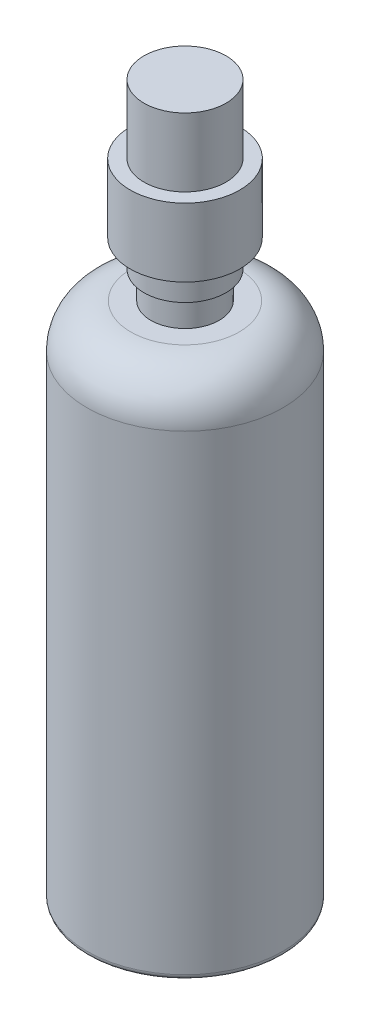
ISO-10303-21;
HEADER;
FILE_DESCRIPTION(('STEP AP214'),'2;1');
FILE_NAME('part.step','',(''),(''),'','','');
FILE_SCHEMA(('AUTOMOTIVE_DESIGN { 1 0 10303 214 1 1 1 1 }'));
ENDSEC;
DATA;
#1=APPLICATION_CONTEXT('core data for automotive mechanical design processes');
#2=APPLICATION_PROTOCOL_DEFINITION('international standard','automotive_design',2000,#1);
#3=PRODUCT_CONTEXT('',#1,'mechanical');
#4=PRODUCT('Part','Part','',(#3));
#5=PRODUCT_RELATED_PRODUCT_CATEGORY('part','',(#4));
#6=PRODUCT_DEFINITION_FORMATION('','',#4);
#7=PRODUCT_DEFINITION_CONTEXT('part definition',#1,'design');
#8=PRODUCT_DEFINITION('design','',#6,#7);
#9=PRODUCT_DEFINITION_SHAPE('','',#8);
#10=(LENGTH_UNIT() NAMED_UNIT(*) SI_UNIT(.MILLI.,.METRE.));
#11=(NAMED_UNIT(*) PLANE_ANGLE_UNIT() SI_UNIT($,.RADIAN.));
#12=(NAMED_UNIT(*) SI_UNIT($,.STERADIAN.) SOLID_ANGLE_UNIT());
#13=UNCERTAINTY_MEASURE_WITH_UNIT(LENGTH_MEASURE(1.E-05),#10,'distance_accuracy_value','');
#14=(GEOMETRIC_REPRESENTATION_CONTEXT(3) GLOBAL_UNCERTAINTY_ASSIGNED_CONTEXT((#13)) GLOBAL_UNIT_ASSIGNED_CONTEXT((#10,
#11,#12)) REPRESENTATION_CONTEXT('',''));
#15=CARTESIAN_POINT('',(0.,0.,0.));
#16=DIRECTION('',(0.,0.,1.));
#17=DIRECTION('',(1.,0.,0.));
#18=AXIS2_PLACEMENT_3D('',#15,#16,#17);
#19=CARTESIAN_POINT('',(0.,0.,0.));
#20=DIRECTION('',(0.,1.,0.));
#21=DIRECTION('',(0.,0.,1.));
#22=AXIS2_PLACEMENT_3D('',#19,#20,#21);
#23=PLANE('',#22);
#24=CARTESIAN_POINT('',(0.,0.,0.));
#25=DIRECTION('',(0.,1.,0.));
#26=DIRECTION('',(0.,0.,1.));
#27=AXIS2_PLACEMENT_3D('',#24,#25,#26);
#28=CIRCLE('',#27,42.96);
#29=CARTESIAN_POINT('',(0.,0.,42.96));
#30=VERTEX_POINT('',#29);
#31=EDGE_CURVE('E53',#30,#30,#28,.F.);
#32=ORIENTED_EDGE('',*,*,#31,.T.);
#33=EDGE_LOOP('',(#32));
#34=FACE_BOUND('',#33,.T.);
#35=ADVANCED_FACE('F45',(#34),#23,.F.);
#36=CARTESIAN_POINT('',(0.,-4.56341729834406,0.));
#37=DIRECTION('',(0.,-1.,0.));
#38=DIRECTION('',(0.,0.,-1.));
#39=AXIS2_PLACEMENT_3D('',#36,#37,#38);
#40=CYLINDRICAL_SURFACE('',#39,45.5);
#41=CARTESIAN_POINT('',(0.,2.54,0.));
#42=DIRECTION('',(0.,1.,0.));
#43=DIRECTION('',(0.,0.,1.));
#44=AXIS2_PLACEMENT_3D('',#41,#42,#43);
#45=CIRCLE('',#44,45.5);
#46=CARTESIAN_POINT('',(0.,2.54,45.5));
#47=VERTEX_POINT('',#46);
#48=EDGE_CURVE('E10',#47,#47,#45,.T.);
#49=ORIENTED_EDGE('',*,*,#48,.T.);
#50=EDGE_LOOP('',(#49));
#51=FACE_BOUND('',#50,.T.);
#52=CARTESIAN_POINT('',(0.,220.98,0.));
#53=DIRECTION('',(0.,-1.,0.));
#54=DIRECTION('',(0.,0.,-1.));
#55=AXIS2_PLACEMENT_3D('',#52,#53,#54);
#56=CIRCLE('',#55,45.5);
#57=CARTESIAN_POINT('',(0.,220.98,-45.5));
#58=VERTEX_POINT('',#57);
#59=EDGE_CURVE('E63',#58,#58,#56,.T.);
#60=ORIENTED_EDGE('',*,*,#59,.T.);
#61=EDGE_LOOP('',(#60));
#62=FACE_BOUND('',#61,.T.);
#63=ADVANCED_FACE('F118',(#51,#62),#40,.T.);
#64=CARTESIAN_POINT('',(-45.5,241.3,0.));
#65=DIRECTION('',(0.,-1.,0.));
#66=DIRECTION('',(0.,0.,-1.));
#67=AXIS2_PLACEMENT_3D('',#64,#65,#66);
#68=PLANE('',#67);
#69=CARTESIAN_POINT('',(0.,241.3,0.));
#70=DIRECTION('',(0.,-1.,0.));
#71=DIRECTION('',(0.,0.,-1.));
#72=AXIS2_PLACEMENT_3D('',#69,#70,#71);
#73=CIRCLE('',#72,25.18);
#74=CARTESIAN_POINT('',(0.,241.3,-25.18));
#75=VERTEX_POINT('',#74);
#76=EDGE_CURVE('E58',#75,#75,#73,.F.);
#77=ORIENTED_EDGE('',*,*,#76,.T.);
#78=EDGE_LOOP('',(#77));
#79=FACE_BOUND('',#78,.T.);
#80=CARTESIAN_POINT('',(0.,241.3,0.));
#81=DIRECTION('',(0.,-1.,0.));
#82=DIRECTION('',(0.,0.,-1.));
#83=AXIS2_PLACEMENT_3D('',#80,#81,#82);
#84=CIRCLE('',#83,15.875);
#85=CARTESIAN_POINT('',(0.,241.3,-15.875));
#86=VERTEX_POINT('',#85);
#87=EDGE_CURVE('E69',#86,#86,#84,.T.);
#88=ORIENTED_EDGE('',*,*,#87,.T.);
#89=EDGE_LOOP('',(#88));
#90=FACE_BOUND('',#89,.T.);
#91=ADVANCED_FACE('F123',(#79,#90),#68,.F.);
#92=CARTESIAN_POINT('',(0.,-4.56341729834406,0.));
#93=DIRECTION('',(0.,-1.,0.));
#94=DIRECTION('',(0.,0.,-1.));
#95=AXIS2_PLACEMENT_3D('',#92,#93,#94);
#96=CYLINDRICAL_SURFACE('',#95,15.875);
#97=ORIENTED_EDGE('',*,*,#87,.F.);
#98=EDGE_LOOP('',(#97));
#99=FACE_BOUND('',#98,.T.);
#100=CARTESIAN_POINT('',(0.,254.,0.));
#101=DIRECTION('',(0.,-1.,0.));
#102=DIRECTION('',(0.,0.,-1.));
#103=AXIS2_PLACEMENT_3D('',#100,#101,#102);
#104=CIRCLE('',#103,15.875);
#105=CARTESIAN_POINT('',(0.,254.,-15.875));
#106=VERTEX_POINT('',#105);
#107=EDGE_CURVE('E73',#106,#106,#104,.T.);
#108=ORIENTED_EDGE('',*,*,#107,.T.);
#109=EDGE_LOOP('',(#108));
#110=FACE_BOUND('',#109,.T.);
#111=ADVANCED_FACE('F127',(#99,#110),#96,.T.);
#112=CARTESIAN_POINT('',(-15.875,254.,0.));
#113=DIRECTION('',(0.,1.,0.));
#114=DIRECTION('',(0.,0.,1.));
#115=AXIS2_PLACEMENT_3D('',#112,#113,#114);
#116=PLANE('',#115);
#117=ORIENTED_EDGE('',*,*,#107,.F.);
#118=EDGE_LOOP('',(#117));
#119=FACE_BOUND('',#118,.T.);
#120=CARTESIAN_POINT('',(0.,254.,0.));
#121=DIRECTION('',(0.,-1.,0.));
#122=DIRECTION('',(0.,0.,-1.));
#123=AXIS2_PLACEMENT_3D('',#120,#121,#122);
#124=CIRCLE('',#123,19.05);
#125=CARTESIAN_POINT('',(0.,254.,-19.05));
#126=VERTEX_POINT('',#125);
#127=EDGE_CURVE('E77',#126,#126,#124,.T.);
#128=ORIENTED_EDGE('',*,*,#127,.T.);
#129=EDGE_LOOP('',(#128));
#130=FACE_BOUND('',#129,.T.);
#131=ADVANCED_FACE('F131',(#119,#130),#116,.F.);
#132=CARTESIAN_POINT('',(0.,-4.56341729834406,0.));
#133=DIRECTION('',(0.,-1.,0.));
#134=DIRECTION('',(0.,0.,-1.));
#135=AXIS2_PLACEMENT_3D('',#132,#133,#134);
#136=CYLINDRICAL_SURFACE('',#135,19.05);
#137=ORIENTED_EDGE('',*,*,#127,.F.);
#138=EDGE_LOOP('',(#137));
#139=FACE_BOUND('',#138,.T.);
#140=CARTESIAN_POINT('',(0.,266.7,0.));
#141=DIRECTION('',(0.,-1.,0.));
#142=DIRECTION('',(0.,0.,-1.));
#143=AXIS2_PLACEMENT_3D('',#140,#141,#142);
#144=CIRCLE('',#143,19.05);
#145=CARTESIAN_POINT('',(0.,266.7,-19.05));
#146=VERTEX_POINT('',#145);
#147=EDGE_CURVE('E81',#146,#146,#144,.T.);
#148=ORIENTED_EDGE('',*,*,#147,.T.);
#149=EDGE_LOOP('',(#148));
#150=FACE_BOUND('',#149,.T.);
#151=ADVANCED_FACE('F135',(#139,#150),#136,.T.);
#152=CARTESIAN_POINT('',(-19.05,266.7,0.));
#153=DIRECTION('',(0.,1.,0.));
#154=DIRECTION('',(0.,0.,1.));
#155=AXIS2_PLACEMENT_3D('',#152,#153,#154);
#156=PLANE('',#155);
#157=ORIENTED_EDGE('',*,*,#147,.F.);
#158=EDGE_LOOP('',(#157));
#159=FACE_BOUND('',#158,.T.);
#160=CARTESIAN_POINT('',(0.,266.7,0.));
#161=DIRECTION('',(0.,-1.,0.));
#162=DIRECTION('',(0.,0.,-1.));
#163=AXIS2_PLACEMENT_3D('',#160,#161,#162);
#164=CIRCLE('',#163,25.4);
#165=CARTESIAN_POINT('',(0.,266.7,-25.4));
#166=VERTEX_POINT('',#165);
#167=EDGE_CURVE('E85',#166,#166,#164,.T.);
#168=ORIENTED_EDGE('',*,*,#167,.T.);
#169=EDGE_LOOP('',(#168));
#170=FACE_BOUND('',#169,.T.);
#171=ADVANCED_FACE('F139',(#159,#170),#156,.F.);
#172=CARTESIAN_POINT('',(0.,-4.56341729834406,0.));
#173=DIRECTION('',(0.,-1.,0.));
#174=DIRECTION('',(0.,0.,-1.));
#175=AXIS2_PLACEMENT_3D('',#172,#173,#174);
#176=CYLINDRICAL_SURFACE('',#175,25.4);
#177=ORIENTED_EDGE('',*,*,#167,.F.);
#178=EDGE_LOOP('',(#177));
#179=FACE_BOUND('',#178,.T.);
#180=CARTESIAN_POINT('',(0.,298.45,0.));
#181=DIRECTION('',(0.,-1.,0.));
#182=DIRECTION('',(0.,0.,-1.));
#183=AXIS2_PLACEMENT_3D('',#180,#181,#182);
#184=CIRCLE('',#183,25.4);
#185=CARTESIAN_POINT('',(0.,298.45,-25.4));
#186=VERTEX_POINT('',#185);
#187=EDGE_CURVE('E89',#186,#186,#184,.T.);
#188=ORIENTED_EDGE('',*,*,#187,.T.);
#189=EDGE_LOOP('',(#188));
#190=FACE_BOUND('',#189,.T.);
#191=ADVANCED_FACE('F143',(#179,#190),#176,.T.);
#192=CARTESIAN_POINT('',(-25.4,298.45,0.));
#193=DIRECTION('',(0.,-1.,0.));
#194=DIRECTION('',(0.,0.,-1.));
#195=AXIS2_PLACEMENT_3D('',#192,#193,#194);
#196=PLANE('',#195);
#197=ORIENTED_EDGE('',*,*,#187,.F.);
#198=EDGE_LOOP('',(#197));
#199=FACE_BOUND('',#198,.T.);
#200=CARTESIAN_POINT('',(0.,298.45,0.));
#201=DIRECTION('',(0.,-1.,0.));
#202=DIRECTION('',(0.,0.,-1.));
#203=AXIS2_PLACEMENT_3D('',#200,#201,#202);
#204=CIRCLE('',#203,19.05);
#205=CARTESIAN_POINT('',(0.,298.45,-19.05));
#206=VERTEX_POINT('',#205);
#207=EDGE_CURVE('E93',#206,#206,#204,.T.);
#208=ORIENTED_EDGE('',*,*,#207,.T.);
#209=EDGE_LOOP('',(#208));
#210=FACE_BOUND('',#209,.T.);
#211=ADVANCED_FACE('F114',(#199,#210),#196,.F.);
#212=CARTESIAN_POINT('',(0.,-4.56341729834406,0.));
#213=DIRECTION('',(0.,-1.,0.));
#214=DIRECTION('',(0.,0.,-1.));
#215=AXIS2_PLACEMENT_3D('',#212,#213,#214);
#216=CYLINDRICAL_SURFACE('',#215,19.05);
#217=ORIENTED_EDGE('',*,*,#207,.F.);
#218=EDGE_LOOP('',(#217));
#219=FACE_BOUND('',#218,.T.);
#220=CARTESIAN_POINT('',(0.,330.2,0.));
#221=DIRECTION('',(0.,-1.,0.));
#222=DIRECTION('',(0.,0.,-1.));
#223=AXIS2_PLACEMENT_3D('',#220,#221,#222);
#224=CIRCLE('',#223,19.05);
#225=CARTESIAN_POINT('',(0.,330.2,-19.05));
#226=VERTEX_POINT('',#225);
#227=EDGE_CURVE('E97',#226,#226,#224,.T.);
#228=ORIENTED_EDGE('',*,*,#227,.T.);
#229=EDGE_LOOP('',(#228));
#230=FACE_BOUND('',#229,.T.);
#231=ADVANCED_FACE('F102',(#219,#230),#216,.T.);
#232=CARTESIAN_POINT('',(-19.05,330.2,0.));
#233=DIRECTION('',(0.,-1.,0.));
#234=DIRECTION('',(0.,0.,-1.));
#235=AXIS2_PLACEMENT_3D('',#232,#233,#234);
#236=PLANE('',#235);
#237=ORIENTED_EDGE('',*,*,#227,.F.);
#238=EDGE_LOOP('',(#237));
#239=FACE_BOUND('',#238,.T.);
#240=ADVANCED_FACE('F104',(#239),#236,.F.);
#241=CARTESIAN_POINT('',(0.,220.98,0.));
#242=DIRECTION('',(0.,-1.,0.));
#243=DIRECTION('',(0.,0.,-1.));
#244=AXIS2_PLACEMENT_3D('',#241,#242,#243);
#245=TOROIDAL_SURFACE('',#244,25.18,20.32);
#246=ORIENTED_EDGE('',*,*,#76,.F.);
#247=EDGE_LOOP('',(#246));
#248=FACE_BOUND('',#247,.T.);
#249=ORIENTED_EDGE('',*,*,#59,.F.);
#250=EDGE_LOOP('',(#249));
#251=FACE_BOUND('',#250,.T.);
#252=ADVANCED_FACE('F106',(#248,#251),#245,.T.);
#253=CARTESIAN_POINT('',(0.,2.54,0.));
#254=DIRECTION('',(0.,1.,0.));
#255=DIRECTION('',(0.,0.,1.));
#256=AXIS2_PLACEMENT_3D('',#253,#254,#255);
#257=TOROIDAL_SURFACE('',#256,42.96,2.54);
#258=ORIENTED_EDGE('',*,*,#48,.F.);
#259=EDGE_LOOP('',(#258));
#260=FACE_BOUND('',#259,.T.);
#261=ORIENTED_EDGE('',*,*,#31,.F.);
#262=EDGE_LOOP('',(#261));
#263=FACE_BOUND('',#262,.T.);
#264=ADVANCED_FACE('F47',(#260,#263),#257,.T.);
#265=CLOSED_SHELL('',(#35,#63,#91,#111,#131,#151,#171,#191,#211,#231,#240,#252,#264));
#266=MANIFOLD_SOLID_BREP('B2',#265);
#267=ADVANCED_BREP_SHAPE_REPRESENTATION('',(#18,#266),#14);
#268=SHAPE_DEFINITION_REPRESENTATION(#9,#267);
ENDSEC;
END-ISO-10303-21;
